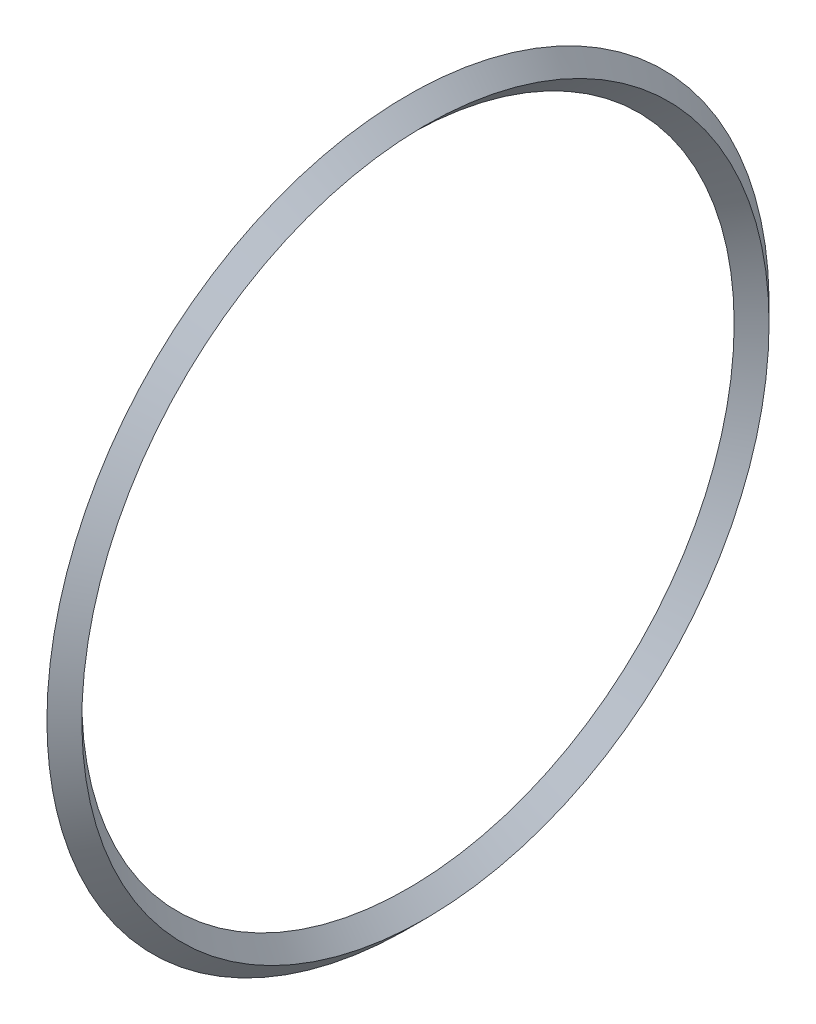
ISO-10303-21;
HEADER;
FILE_DESCRIPTION(('STEP AP214'),'2;1');
FILE_NAME('part.step','',(''),(''),'','','');
FILE_SCHEMA(('AUTOMOTIVE_DESIGN { 1 0 10303 214 1 1 1 1 }'));
ENDSEC;
DATA;
#1=APPLICATION_CONTEXT('core data for automotive mechanical design processes');
#2=APPLICATION_PROTOCOL_DEFINITION('international standard','automotive_design',2000,#1);
#3=PRODUCT_CONTEXT('',#1,'mechanical');
#4=PRODUCT('Part','Part','',(#3));
#5=PRODUCT_RELATED_PRODUCT_CATEGORY('part','',(#4));
#6=PRODUCT_DEFINITION_FORMATION('','',#4);
#7=PRODUCT_DEFINITION_CONTEXT('part definition',#1,'design');
#8=PRODUCT_DEFINITION('design','',#6,#7);
#9=PRODUCT_DEFINITION_SHAPE('','',#8);
#10=(LENGTH_UNIT() NAMED_UNIT(*) SI_UNIT(.MILLI.,.METRE.));
#11=(NAMED_UNIT(*) PLANE_ANGLE_UNIT() SI_UNIT($,.RADIAN.));
#12=(NAMED_UNIT(*) SI_UNIT($,.STERADIAN.) SOLID_ANGLE_UNIT());
#13=UNCERTAINTY_MEASURE_WITH_UNIT(LENGTH_MEASURE(1.E-05),#10,'distance_accuracy_value','');
#14=(GEOMETRIC_REPRESENTATION_CONTEXT(3) GLOBAL_UNCERTAINTY_ASSIGNED_CONTEXT((#13)) GLOBAL_UNIT_ASSIGNED_CONTEXT((#10,
#11,#12)) REPRESENTATION_CONTEXT('',''));
#15=CARTESIAN_POINT('',(0.,0.,0.));
#16=DIRECTION('',(0.,0.,1.));
#17=DIRECTION('',(1.,0.,0.));
#18=AXIS2_PLACEMENT_3D('',#15,#16,#17);
#19=CARTESIAN_POINT('',(-250.063386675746,12.4123255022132,0.));
#20=DIRECTION('',(-1.,0.,0.));
#21=DIRECTION('',(0.,-0.286994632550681,0.957932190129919));
#22=AXIS2_PLACEMENT_3D('',#19,#20,#21);
#23=CONICAL_SURFACE('',#22,105.5,0.785398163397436);
#24=CARTESIAN_POINT('',(-242.063386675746,12.4123255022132,0.));
#25=DIRECTION('',(-1.,0.,0.));
#26=DIRECTION('',(0.,-0.286994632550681,0.957932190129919));
#27=AXIS2_PLACEMENT_3D('',#24,#25,#26);
#28=CIRCLE('',#27,97.5);
#29=CARTESIAN_POINT('',(-242.063386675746,-15.5696511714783,93.3983885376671));
#30=VERTEX_POINT('',#29);
#31=EDGE_CURVE('E66',#30,#30,#28,.T.);
#32=ORIENTED_EDGE('',*,*,#31,.T.);
#33=EDGE_LOOP('',(#32));
#34=FACE_BOUND('',#33,.T.);
#35=CARTESIAN_POINT('',(-247.013134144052,12.4123255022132,0.));
#36=DIRECTION('',(-1.,0.,0.));
#37=DIRECTION('',(0.,0.,1.));
#38=AXIS2_PLACEMENT_3D('',#35,#36,#37);
#39=CIRCLE('',#38,102.449747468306);
#40=CARTESIAN_POINT('',(-247.013134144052,12.4123255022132,102.449747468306));
#41=VERTEX_POINT('',#40);
#42=EDGE_CURVE('E59',#41,#41,#39,.T.);
#43=ORIENTED_EDGE('',*,*,#42,.F.);
#44=EDGE_LOOP('',(#43));
#45=FACE_BOUND('',#44,.T.);
#46=ADVANCED_FACE('F55',(#34,#45),#23,.T.);
#47=CARTESIAN_POINT('',(-242.063386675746,12.4123255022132,0.));
#48=DIRECTION('',(1.,0.,0.));
#49=DIRECTION('',(0.,0.,-1.));
#50=AXIS2_PLACEMENT_3D('',#47,#48,#49);
#51=CONICAL_SURFACE('',#50,97.5,0.785398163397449);
#52=ORIENTED_EDGE('',*,*,#31,.F.);
#53=EDGE_LOOP('',(#52));
#54=FACE_BOUND('',#53,.T.);
#55=CARTESIAN_POINT('',(-247.013134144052,12.4123255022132,0.));
#56=DIRECTION('',(1.,0.,0.));
#57=DIRECTION('',(0.,0.,-1.));
#58=AXIS2_PLACEMENT_3D('',#55,#56,#57);
#59=CIRCLE('',#58,92.5502525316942);
#60=CARTESIAN_POINT('',(-247.013134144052,12.4123255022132,-92.5502525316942));
#61=VERTEX_POINT('',#60);
#62=EDGE_CURVE('E11',#61,#61,#59,.T.);
#63=ORIENTED_EDGE('',*,*,#62,.F.);
#64=EDGE_LOOP('',(#63));
#65=FACE_BOUND('',#64,.T.);
#66=ADVANCED_FACE('F73',(#54,#65),#51,.F.);
#67=CARTESIAN_POINT('',(-247.013134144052,-5.88712441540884,91.3322619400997));
#68=DIRECTION('',(-1.,0.,0.));
#69=DIRECTION('',(0.,-0.196456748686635,0.980512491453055));
#70=AXIS2_PLACEMENT_3D('',#67,#68,#69);
#71=PLANE('',#70);
#72=ORIENTED_EDGE('',*,*,#62,.T.);
#73=EDGE_LOOP('',(#72));
#74=FACE_BOUND('',#73,.T.);
#75=ORIENTED_EDGE('',*,*,#42,.T.);
#76=EDGE_LOOP('',(#75));
#77=FACE_BOUND('',#76,.T.);
#78=ADVANCED_FACE('F57',(#74,#77),#71,.T.);
#79=CLOSED_SHELL('',(#46,#66,#78));
#80=MANIFOLD_SOLID_BREP('B2',#79);
#81=ADVANCED_BREP_SHAPE_REPRESENTATION('',(#18,#80),#14);
#82=SHAPE_DEFINITION_REPRESENTATION(#9,#81);
ENDSEC;
END-ISO-10303-21;
